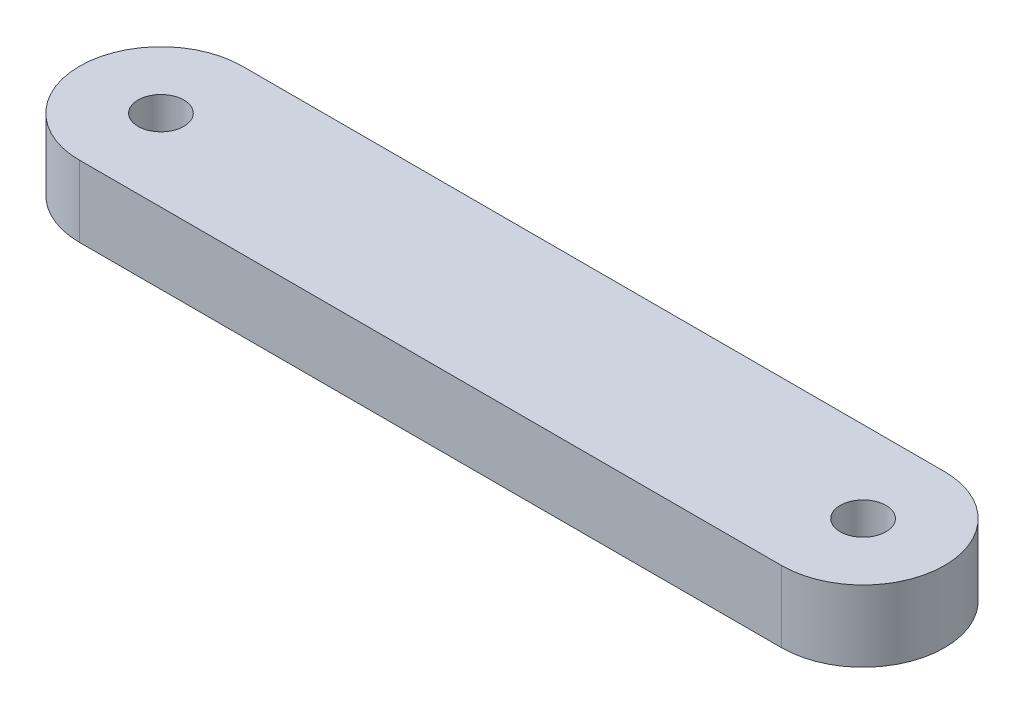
ISO-10303-21;
HEADER;
FILE_DESCRIPTION(('STEP AP214'),'2;1');
FILE_NAME('part.step','',(''),(''),'','','');
FILE_SCHEMA(('AUTOMOTIVE_DESIGN { 1 0 10303 214 1 1 1 1 }'));
ENDSEC;
DATA;
#1=APPLICATION_CONTEXT('core data for automotive mechanical design processes');
#2=APPLICATION_PROTOCOL_DEFINITION('international standard','automotive_design',2000,#1);
#3=PRODUCT_CONTEXT('',#1,'mechanical');
#4=PRODUCT('Part','Part','',(#3));
#5=PRODUCT_RELATED_PRODUCT_CATEGORY('part','',(#4));
#6=PRODUCT_DEFINITION_FORMATION('','',#4);
#7=PRODUCT_DEFINITION_CONTEXT('part definition',#1,'design');
#8=PRODUCT_DEFINITION('design','',#6,#7);
#9=PRODUCT_DEFINITION_SHAPE('','',#8);
#10=(LENGTH_UNIT() NAMED_UNIT(*) SI_UNIT(.MILLI.,.METRE.));
#11=(NAMED_UNIT(*) PLANE_ANGLE_UNIT() SI_UNIT($,.RADIAN.));
#12=(NAMED_UNIT(*) SI_UNIT($,.STERADIAN.) SOLID_ANGLE_UNIT());
#13=UNCERTAINTY_MEASURE_WITH_UNIT(LENGTH_MEASURE(1.E-05),#10,'distance_accuracy_value','');
#14=(GEOMETRIC_REPRESENTATION_CONTEXT(3) GLOBAL_UNCERTAINTY_ASSIGNED_CONTEXT((#13)) GLOBAL_UNIT_ASSIGNED_CONTEXT((#10,
#11,#12)) REPRESENTATION_CONTEXT('',''));
#15=CARTESIAN_POINT('',(0.,0.,0.));
#16=DIRECTION('',(0.,0.,1.));
#17=DIRECTION('',(1.,0.,0.));
#18=AXIS2_PLACEMENT_3D('',#15,#16,#17);
#19=CARTESIAN_POINT('',(-87.63,17.78,0.));
#20=DIRECTION('',(0.,1.,0.));
#21=DIRECTION('',(0.,0.,1.));
#22=AXIS2_PLACEMENT_3D('',#19,#20,#21);
#23=PLANE('',#22);
#24=CARTESIAN_POINT('',(-87.63,17.78,0.));
#25=DIRECTION('',(0.,1.,0.));
#26=DIRECTION('',(0.,0.,1.));
#27=AXIS2_PLACEMENT_3D('',#24,#25,#26);
#28=CIRCLE('',#27,5.71499999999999);
#29=CARTESIAN_POINT('',(-87.63,17.78,5.71499999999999));
#30=VERTEX_POINT('',#29);
#31=EDGE_CURVE('E100',#30,#30,#28,.T.);
#32=ORIENTED_EDGE('',*,*,#31,.F.);
#33=EDGE_LOOP('',(#32));
#34=FACE_BOUND('',#33,.T.);
#35=CARTESIAN_POINT('',(-87.63,17.78,0.));
#36=DIRECTION('',(0.,1.,0.));
#37=DIRECTION('',(0.,0.,1.));
#38=AXIS2_PLACEMENT_3D('',#35,#36,#37);
#39=CIRCLE('',#38,20.32);
#40=CARTESIAN_POINT('',(-87.63,17.78,-20.32));
#41=VERTEX_POINT('',#40);
#42=CARTESIAN_POINT('',(-87.63,17.78,20.32));
#43=VERTEX_POINT('',#42);
#44=EDGE_CURVE('E85',#41,#43,#39,.T.);
#45=ORIENTED_EDGE('',*,*,#44,.T.);
#46=DIRECTION('',(1.,0.,0.));
#47=VECTOR('',#46,1.);
#48=CARTESIAN_POINT('',(-87.63,17.78,20.32));
#49=LINE('',#48,#47);
#50=CARTESIAN_POINT('',(87.63,17.78,20.32));
#51=VERTEX_POINT('',#50);
#52=EDGE_CURVE('E80',#43,#51,#49,.T.);
#53=ORIENTED_EDGE('',*,*,#52,.T.);
#54=CARTESIAN_POINT('',(87.63,17.78,0.));
#55=DIRECTION('',(0.,1.,0.));
#56=DIRECTION('',(0.,0.,1.));
#57=AXIS2_PLACEMENT_3D('',#54,#55,#56);
#58=CIRCLE('',#57,20.32);
#59=CARTESIAN_POINT('',(87.63,17.78,-20.32));
#60=VERTEX_POINT('',#59);
#61=EDGE_CURVE('E83',#51,#60,#58,.T.);
#62=ORIENTED_EDGE('',*,*,#61,.T.);
#63=DIRECTION('',(-1.,0.,0.));
#64=VECTOR('',#63,1.);
#65=CARTESIAN_POINT('',(-87.63,17.78,-20.32));
#66=LINE('',#65,#64);
#67=EDGE_CURVE('E50',#60,#41,#66,.T.);
#68=ORIENTED_EDGE('',*,*,#67,.T.);
#69=EDGE_LOOP('',(#45,#53,#62,#68));
#70=FACE_BOUND('',#69,.T.);
#71=CARTESIAN_POINT('',(87.63,17.78,0.));
#72=DIRECTION('',(0.,1.,0.));
#73=DIRECTION('',(0.,0.,1.));
#74=AXIS2_PLACEMENT_3D('',#71,#72,#73);
#75=CIRCLE('',#74,5.71499999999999);
#76=CARTESIAN_POINT('',(87.63,17.78,5.71499999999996));
#77=VERTEX_POINT('',#76);
#78=EDGE_CURVE('E115',#77,#77,#75,.T.);
#79=ORIENTED_EDGE('',*,*,#78,.F.);
#80=EDGE_LOOP('',(#79));
#81=FACE_BOUND('',#80,.T.);
#82=ADVANCED_FACE('F33',(#34,#70,#81),#23,.T.);
#83=CARTESIAN_POINT('',(-87.63,0.,0.));
#84=DIRECTION('',(0.,1.,0.));
#85=DIRECTION('',(0.,0.,1.));
#86=AXIS2_PLACEMENT_3D('',#83,#84,#85);
#87=PLANE('',#86);
#88=CARTESIAN_POINT('',(-87.63,0.,0.));
#89=DIRECTION('',(0.,1.,0.));
#90=DIRECTION('',(0.,0.,1.));
#91=AXIS2_PLACEMENT_3D('',#88,#89,#90);
#92=CIRCLE('',#91,20.32);
#93=CARTESIAN_POINT('',(-87.63,0.,-20.32));
#94=VERTEX_POINT('',#93);
#95=CARTESIAN_POINT('',(-87.63,0.,20.32));
#96=VERTEX_POINT('',#95);
#97=EDGE_CURVE('E97',#94,#96,#92,.T.);
#98=ORIENTED_EDGE('',*,*,#97,.F.);
#99=DIRECTION('',(-1.,0.,0.));
#100=VECTOR('',#99,1.);
#101=CARTESIAN_POINT('',(-87.63,0.,-20.32));
#102=LINE('',#101,#100);
#103=CARTESIAN_POINT('',(87.63,0.,-20.32));
#104=VERTEX_POINT('',#103);
#105=EDGE_CURVE('E73',#104,#94,#102,.T.);
#106=ORIENTED_EDGE('',*,*,#105,.F.);
#107=CARTESIAN_POINT('',(87.63,0.,0.));
#108=DIRECTION('',(0.,1.,0.));
#109=DIRECTION('',(0.,0.,1.));
#110=AXIS2_PLACEMENT_3D('',#107,#108,#109);
#111=CIRCLE('',#110,20.32);
#112=CARTESIAN_POINT('',(87.63,0.,20.32));
#113=VERTEX_POINT('',#112);
#114=EDGE_CURVE('E67',#113,#104,#111,.T.);
#115=ORIENTED_EDGE('',*,*,#114,.F.);
#116=DIRECTION('',(1.,0.,0.));
#117=VECTOR('',#116,1.);
#118=CARTESIAN_POINT('',(-87.63,0.,20.32));
#119=LINE('',#118,#117);
#120=EDGE_CURVE('E89',#96,#113,#119,.T.);
#121=ORIENTED_EDGE('',*,*,#120,.F.);
#122=EDGE_LOOP('',(#98,#106,#115,#121));
#123=FACE_BOUND('',#122,.T.);
#124=CARTESIAN_POINT('',(-87.63,0.,0.));
#125=DIRECTION('',(0.,1.,0.));
#126=DIRECTION('',(0.,0.,1.));
#127=AXIS2_PLACEMENT_3D('',#124,#125,#126);
#128=CIRCLE('',#127,5.71499999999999);
#129=CARTESIAN_POINT('',(-87.63,0.,5.71499999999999));
#130=VERTEX_POINT('',#129);
#131=EDGE_CURVE('E112',#130,#130,#128,.T.);
#132=ORIENTED_EDGE('',*,*,#131,.T.);
#133=EDGE_LOOP('',(#132));
#134=FACE_BOUND('',#133,.T.);
#135=CARTESIAN_POINT('',(87.63,0.,0.));
#136=DIRECTION('',(0.,1.,0.));
#137=DIRECTION('',(0.,0.,1.));
#138=AXIS2_PLACEMENT_3D('',#135,#136,#137);
#139=CIRCLE('',#138,5.71499999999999);
#140=CARTESIAN_POINT('',(87.63,0.,5.71499999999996));
#141=VERTEX_POINT('',#140);
#142=EDGE_CURVE('E118',#141,#141,#139,.T.);
#143=ORIENTED_EDGE('',*,*,#142,.T.);
#144=EDGE_LOOP('',(#143));
#145=FACE_BOUND('',#144,.T.);
#146=ADVANCED_FACE('F108',(#123,#134,#145),#87,.F.);
#147=CARTESIAN_POINT('',(-87.63,17.78,0.));
#148=DIRECTION('',(0.,-1.,0.));
#149=DIRECTION('',(0.,0.,-1.));
#150=AXIS2_PLACEMENT_3D('',#147,#148,#149);
#151=CYLINDRICAL_SURFACE('',#150,20.32);
#152=ORIENTED_EDGE('',*,*,#97,.T.);
#153=DIRECTION('',(0.,-1.,0.));
#154=VECTOR('',#153,1.);
#155=CARTESIAN_POINT('',(-87.63,17.78,20.32));
#156=LINE('',#155,#154);
#157=EDGE_CURVE('E11',#43,#96,#156,.T.);
#158=ORIENTED_EDGE('',*,*,#157,.F.);
#159=ORIENTED_EDGE('',*,*,#44,.F.);
#160=DIRECTION('',(0.,-1.,0.));
#161=VECTOR('',#160,1.);
#162=CARTESIAN_POINT('',(-87.63,17.78,-20.32));
#163=LINE('',#162,#161);
#164=EDGE_CURVE('E93',#41,#94,#163,.T.);
#165=ORIENTED_EDGE('',*,*,#164,.T.);
#166=EDGE_LOOP('',(#152,#158,#159,#165));
#167=FACE_BOUND('',#166,.T.);
#168=ADVANCED_FACE('F35',(#167),#151,.T.);
#169=CARTESIAN_POINT('',(-87.63,17.78,20.32));
#170=DIRECTION('',(0.,0.,-1.));
#171=DIRECTION('',(-1.,0.,0.));
#172=AXIS2_PLACEMENT_3D('',#169,#170,#171);
#173=PLANE('',#172);
#174=ORIENTED_EDGE('',*,*,#120,.T.);
#175=DIRECTION('',(0.,-1.,0.));
#176=VECTOR('',#175,1.);
#177=CARTESIAN_POINT('',(87.63,17.78,20.32));
#178=LINE('',#177,#176);
#179=EDGE_CURVE('E42',#51,#113,#178,.T.);
#180=ORIENTED_EDGE('',*,*,#179,.F.);
#181=ORIENTED_EDGE('',*,*,#52,.F.);
#182=ORIENTED_EDGE('',*,*,#157,.T.);
#183=EDGE_LOOP('',(#174,#180,#181,#182));
#184=FACE_BOUND('',#183,.T.);
#185=ADVANCED_FACE('F88',(#184),#173,.F.);
#186=CARTESIAN_POINT('',(87.63,17.78,0.));
#187=DIRECTION('',(0.,-1.,0.));
#188=DIRECTION('',(0.,0.,-1.));
#189=AXIS2_PLACEMENT_3D('',#186,#187,#188);
#190=CYLINDRICAL_SURFACE('',#189,20.32);
#191=ORIENTED_EDGE('',*,*,#114,.T.);
#192=DIRECTION('',(0.,-1.,0.));
#193=VECTOR('',#192,1.);
#194=CARTESIAN_POINT('',(87.63,17.78,-20.32));
#195=LINE('',#194,#193);
#196=EDGE_CURVE('E90',#60,#104,#195,.T.);
#197=ORIENTED_EDGE('',*,*,#196,.F.);
#198=ORIENTED_EDGE('',*,*,#61,.F.);
#199=ORIENTED_EDGE('',*,*,#179,.T.);
#200=EDGE_LOOP('',(#191,#197,#198,#199));
#201=FACE_BOUND('',#200,.T.);
#202=ADVANCED_FACE('F91',(#201),#190,.T.);
#203=CARTESIAN_POINT('',(-87.63,17.78,-20.32));
#204=DIRECTION('',(0.,0.,1.));
#205=DIRECTION('',(1.,0.,0.));
#206=AXIS2_PLACEMENT_3D('',#203,#204,#205);
#207=PLANE('',#206);
#208=ORIENTED_EDGE('',*,*,#105,.T.);
#209=ORIENTED_EDGE('',*,*,#164,.F.);
#210=ORIENTED_EDGE('',*,*,#67,.F.);
#211=ORIENTED_EDGE('',*,*,#196,.T.);
#212=EDGE_LOOP('',(#208,#209,#210,#211));
#213=FACE_BOUND('',#212,.T.);
#214=ADVANCED_FACE('F105',(#213),#207,.F.);
#215=CARTESIAN_POINT('',(-87.63,17.78,0.));
#216=DIRECTION('',(0.,-1.,0.));
#217=DIRECTION('',(0.,0.,-1.));
#218=AXIS2_PLACEMENT_3D('',#215,#216,#217);
#219=CYLINDRICAL_SURFACE('',#218,5.71499999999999);
#220=ORIENTED_EDGE('',*,*,#31,.T.);
#221=EDGE_LOOP('',(#220));
#222=FACE_BOUND('',#221,.T.);
#223=ORIENTED_EDGE('',*,*,#131,.F.);
#224=EDGE_LOOP('',(#223));
#225=FACE_BOUND('',#224,.T.);
#226=ADVANCED_FACE('F135',(#222,#225),#219,.F.);
#227=CARTESIAN_POINT('',(87.63,17.78,0.));
#228=DIRECTION('',(0.,-1.,0.));
#229=DIRECTION('',(0.,0.,-1.));
#230=AXIS2_PLACEMENT_3D('',#227,#228,#229);
#231=CYLINDRICAL_SURFACE('',#230,5.71499999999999);
#232=ORIENTED_EDGE('',*,*,#78,.T.);
#233=EDGE_LOOP('',(#232));
#234=FACE_BOUND('',#233,.T.);
#235=ORIENTED_EDGE('',*,*,#142,.F.);
#236=EDGE_LOOP('',(#235));
#237=FACE_BOUND('',#236,.T.);
#238=ADVANCED_FACE('F124',(#234,#237),#231,.F.);
#239=CLOSED_SHELL('',(#82,#146,#168,#185,#202,#214,#226,#238));
#240=MANIFOLD_SOLID_BREP('B2',#239);
#241=ADVANCED_BREP_SHAPE_REPRESENTATION('',(#18,#240),#14);
#242=SHAPE_DEFINITION_REPRESENTATION(#9,#241);
ENDSEC;
END-ISO-10303-21;
